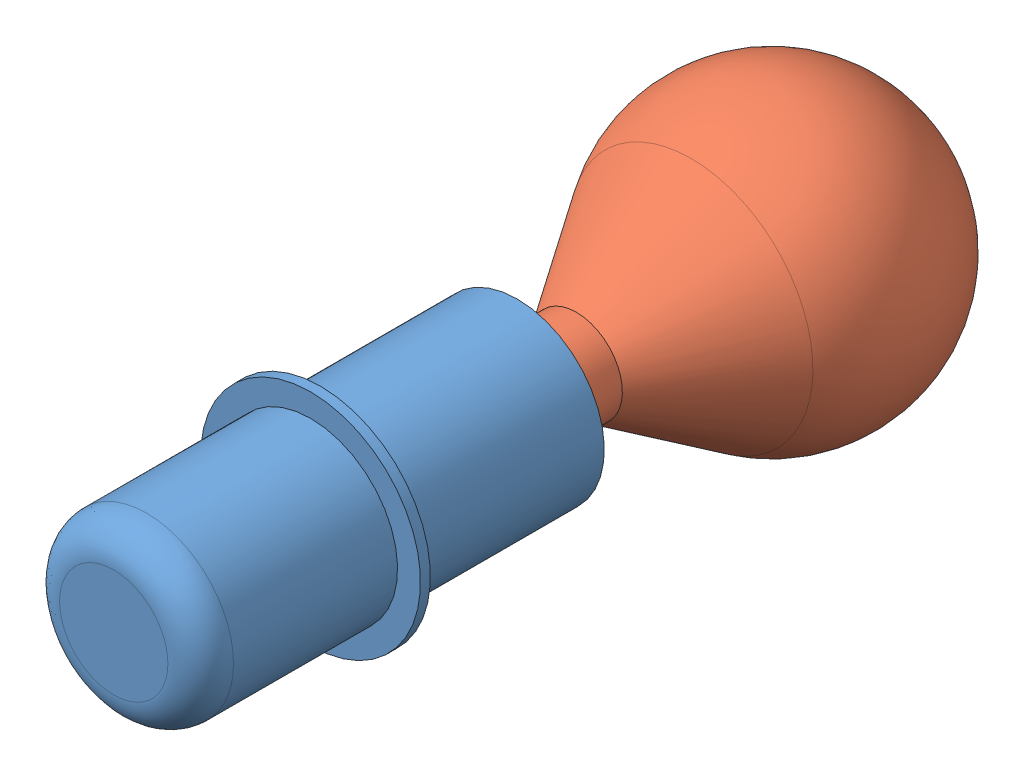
SolidWorks assembly Lampe_Assemblage.SLDASM, configuration Défaut (file format 14000). Lengths in mm.
Overall size (44.5 44.5 122.5).
2 component instances, 2 part files, 1 mates.
Components (placement in the parent):
- Lampe_Douille-1: Lampe_Douille.SLDPRT [Défaut] at (-2.677 -2.4363 61.5) size (33.5 33.5 61.5)
- Lampe_Ampoule-1: Lampe_Ampoule.SLDPRT [Défaut] at (-2.677 4.5637 18) size (44.5 44.5 79)
Mates (geometry in assembly coordinates):
- Coïncidente1: coincident anti-aligned: circle of Lampe_Douille-1; circle of Lampe_Ampoule-1
